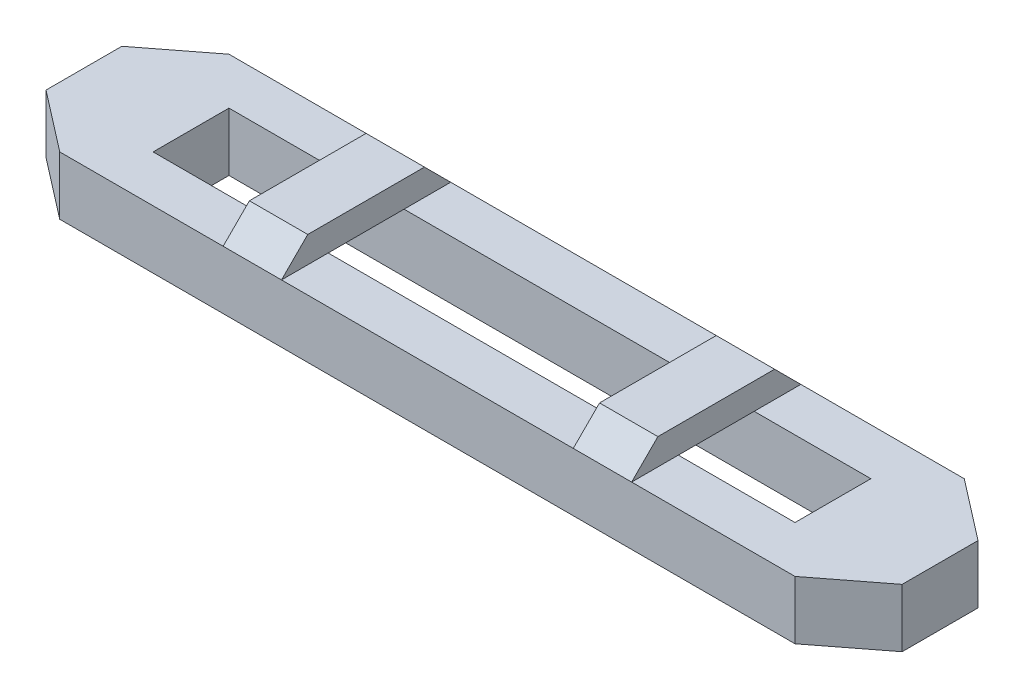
ISO-10303-21;
HEADER;
FILE_DESCRIPTION(('STEP AP214'),'2;1');
FILE_NAME('part.step','',(''),(''),'','','');
FILE_SCHEMA(('AUTOMOTIVE_DESIGN { 1 0 10303 214 1 1 1 1 }'));
ENDSEC;
DATA;
#1=APPLICATION_CONTEXT('core data for automotive mechanical design processes');
#2=APPLICATION_PROTOCOL_DEFINITION('international standard','automotive_design',2000,#1);
#3=PRODUCT_CONTEXT('',#1,'mechanical');
#4=PRODUCT('Part','Part','',(#3));
#5=PRODUCT_RELATED_PRODUCT_CATEGORY('part','',(#4));
#6=PRODUCT_DEFINITION_FORMATION('','',#4);
#7=PRODUCT_DEFINITION_CONTEXT('part definition',#1,'design');
#8=PRODUCT_DEFINITION('design','',#6,#7);
#9=PRODUCT_DEFINITION_SHAPE('','',#8);
#10=(LENGTH_UNIT() NAMED_UNIT(*) SI_UNIT(.MILLI.,.METRE.));
#11=(NAMED_UNIT(*) PLANE_ANGLE_UNIT() SI_UNIT($,.RADIAN.));
#12=(NAMED_UNIT(*) SI_UNIT($,.STERADIAN.) SOLID_ANGLE_UNIT());
#13=UNCERTAINTY_MEASURE_WITH_UNIT(LENGTH_MEASURE(1.E-05),#10,'distance_accuracy_value','');
#14=(GEOMETRIC_REPRESENTATION_CONTEXT(3) GLOBAL_UNCERTAINTY_ASSIGNED_CONTEXT((#13)) GLOBAL_UNIT_ASSIGNED_CONTEXT((#10,
#11,#12)) REPRESENTATION_CONTEXT('',''));
#15=CARTESIAN_POINT('',(0.,0.,0.));
#16=DIRECTION('',(0.,0.,1.));
#17=DIRECTION('',(1.,0.,0.));
#18=AXIS2_PLACEMENT_3D('',#15,#16,#17);
#19=CARTESIAN_POINT('',(-81.7701905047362,10.,0.));
#20=DIRECTION('',(0.,-1.,0.));
#21=DIRECTION('',(0.,0.,-1.));
#22=AXIS2_PLACEMENT_3D('',#19,#20,#21);
#23=PLANE('',#22);
#24=DIRECTION('',(0.,0.,-1.));
#25=VECTOR('',#24,1.);
#26=CARTESIAN_POINT('',(-35.,10.,14.5));
#27=LINE('',#26,#25);
#28=CARTESIAN_POINT('',(-35.,10.,-6.5));
#29=VERTEX_POINT('',#28);
#30=CARTESIAN_POINT('',(-35.,10.,-14.5));
#31=VERTEX_POINT('',#30);
#32=EDGE_CURVE('E220',#29,#31,#27,.T.);
#33=ORIENTED_EDGE('',*,*,#32,.T.);
#34=DIRECTION('',(-1.,0.,0.));
#35=VECTOR('',#34,1.);
#36=CARTESIAN_POINT('',(-63.,10.,-14.5));
#37=LINE('',#36,#35);
#38=CARTESIAN_POINT('',(-63.,10.,-14.5));
#39=VERTEX_POINT('',#38);
#40=EDGE_CURVE('E440',#31,#39,#37,.T.);
#41=ORIENTED_EDGE('',*,*,#40,.T.);
#42=DIRECTION('',(-0.79137144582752,0.,0.611335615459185));
#43=VECTOR('',#42,1.);
#44=CARTESIAN_POINT('',(-63.,10.,-14.5));
#45=LINE('',#44,#43);
#46=CARTESIAN_POINT('',(-73.3559671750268,10.,-6.5));
#47=VERTEX_POINT('',#46);
#48=EDGE_CURVE('E370',#39,#47,#45,.T.);
#49=ORIENTED_EDGE('',*,*,#48,.T.);
#50=DIRECTION('',(0.,0.,1.));
#51=VECTOR('',#50,1.);
#52=CARTESIAN_POINT('',(-73.3559671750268,10.,-6.5));
#53=LINE('',#52,#51);
#54=CARTESIAN_POINT('',(-73.3559671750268,10.,6.5));
#55=VERTEX_POINT('',#54);
#56=EDGE_CURVE('E373',#47,#55,#53,.T.);
#57=ORIENTED_EDGE('',*,*,#56,.T.);
#58=DIRECTION('',(0.79137144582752,0.,0.611335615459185));
#59=VECTOR('',#58,1.);
#60=CARTESIAN_POINT('',(-63.,10.,14.5));
#61=LINE('',#60,#59);
#62=CARTESIAN_POINT('',(-63.,10.,14.5));
#63=VERTEX_POINT('',#62);
#64=EDGE_CURVE('E376',#55,#63,#61,.T.);
#65=ORIENTED_EDGE('',*,*,#64,.T.);
#66=DIRECTION('',(1.,0.,0.));
#67=VECTOR('',#66,1.);
#68=CARTESIAN_POINT('',(-63.,10.,14.5));
#69=LINE('',#68,#67);
#70=CARTESIAN_POINT('',(-35.,10.,14.5));
#71=VERTEX_POINT('',#70);
#72=EDGE_CURVE('E387',#63,#71,#69,.T.);
#73=ORIENTED_EDGE('',*,*,#72,.T.);
#74=CARTESIAN_POINT('',(-35.,10.,6.5));
#75=VERTEX_POINT('',#74);
#76=EDGE_CURVE('E214',#71,#75,#27,.T.);
#77=ORIENTED_EDGE('',*,*,#76,.T.);
#78=DIRECTION('',(1.,0.,0.));
#79=VECTOR('',#78,1.);
#80=CARTESIAN_POINT('',(-55.,10.,6.5));
#81=LINE('',#80,#79);
#82=CARTESIAN_POINT('',(-55.,10.,6.5));
#83=VERTEX_POINT('',#82);
#84=EDGE_CURVE('E328',#83,#75,#81,.T.);
#85=ORIENTED_EDGE('',*,*,#84,.F.);
#86=DIRECTION('',(0.,0.,1.));
#87=VECTOR('',#86,1.);
#88=CARTESIAN_POINT('',(-55.,10.,-6.5));
#89=LINE('',#88,#87);
#90=CARTESIAN_POINT('',(-55.,10.,-6.5));
#91=VERTEX_POINT('',#90);
#92=EDGE_CURVE('E329',#91,#83,#89,.T.);
#93=ORIENTED_EDGE('',*,*,#92,.F.);
#94=DIRECTION('',(-1.,0.,0.));
#95=VECTOR('',#94,1.);
#96=CARTESIAN_POINT('',(-55.,10.,-6.5));
#97=LINE('',#96,#95);
#98=EDGE_CURVE('E337',#29,#91,#97,.T.);
#99=ORIENTED_EDGE('',*,*,#98,.F.);
#100=EDGE_LOOP('',(#33,#41,#49,#57,#65,#73,#77,#85,#93,#99));
#101=FACE_BOUND('',#100,.T.);
#102=ADVANCED_FACE('F30',(#101),#23,.F.);
#103=CARTESIAN_POINT('',(25.,10.,-14.5));
#104=VERTEX_POINT('',#103);
#105=CARTESIAN_POINT('',(-25.,10.,-14.5));
#106=VERTEX_POINT('',#105);
#107=EDGE_CURVE('E435',#104,#106,#37,.T.);
#108=ORIENTED_EDGE('',*,*,#107,.T.);
#109=DIRECTION('',(0.,0.,-1.));
#110=VECTOR('',#109,1.);
#111=CARTESIAN_POINT('',(-25.,10.,14.5));
#112=LINE('',#111,#110);
#113=CARTESIAN_POINT('',(-25.,10.,-6.5));
#114=VERTEX_POINT('',#113);
#115=EDGE_CURVE('E231',#114,#106,#112,.T.);
#116=ORIENTED_EDGE('',*,*,#115,.F.);
#117=CARTESIAN_POINT('',(25.,10.,-6.5));
#118=VERTEX_POINT('',#117);
#119=EDGE_CURVE('E509',#118,#114,#97,.T.);
#120=ORIENTED_EDGE('',*,*,#119,.F.);
#121=DIRECTION('',(0.,0.,-1.));
#122=VECTOR('',#121,1.);
#123=CARTESIAN_POINT('',(25.,10.,14.5));
#124=LINE('',#123,#122);
#125=EDGE_CURVE('E11',#118,#104,#124,.T.);
#126=ORIENTED_EDGE('',*,*,#125,.T.);
#127=EDGE_LOOP('',(#108,#116,#120,#126));
#128=FACE_BOUND('',#127,.T.);
#129=ADVANCED_FACE('F510',(#128),#23,.F.);
#130=DIRECTION('',(0.,0.,-1.));
#131=VECTOR('',#130,1.);
#132=CARTESIAN_POINT('',(35.,10.,14.5));
#133=LINE('',#132,#131);
#134=CARTESIAN_POINT('',(35.,10.,14.5));
#135=VERTEX_POINT('',#134);
#136=CARTESIAN_POINT('',(35.,10.,6.5));
#137=VERTEX_POINT('',#136);
#138=EDGE_CURVE('E245',#135,#137,#133,.T.);
#139=ORIENTED_EDGE('',*,*,#138,.F.);
#140=CARTESIAN_POINT('',(63.,10.,14.5));
#141=VERTEX_POINT('',#140);
#142=EDGE_CURVE('E377',#135,#141,#69,.T.);
#143=ORIENTED_EDGE('',*,*,#142,.T.);
#144=DIRECTION('',(0.79137144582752,0.,-0.611335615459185));
#145=VECTOR('',#144,1.);
#146=CARTESIAN_POINT('',(63.,10.,14.5));
#147=LINE('',#146,#145);
#148=CARTESIAN_POINT('',(73.3559671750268,10.,6.5));
#149=VERTEX_POINT('',#148);
#150=EDGE_CURVE('E380',#141,#149,#147,.T.);
#151=ORIENTED_EDGE('',*,*,#150,.T.);
#152=DIRECTION('',(0.,0.,-1.));
#153=VECTOR('',#152,1.);
#154=CARTESIAN_POINT('',(73.3559671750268,10.,-6.5));
#155=LINE('',#154,#153);
#156=CARTESIAN_POINT('',(73.3559671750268,10.,-6.5));
#157=VERTEX_POINT('',#156);
#158=EDGE_CURVE('E448',#149,#157,#155,.T.);
#159=ORIENTED_EDGE('',*,*,#158,.T.);
#160=DIRECTION('',(-0.79137144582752,0.,-0.611335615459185));
#161=VECTOR('',#160,1.);
#162=CARTESIAN_POINT('',(63.,10.,-14.5));
#163=LINE('',#162,#161);
#164=CARTESIAN_POINT('',(63.,10.,-14.5));
#165=VERTEX_POINT('',#164);
#166=EDGE_CURVE('E432',#157,#165,#163,.T.);
#167=ORIENTED_EDGE('',*,*,#166,.T.);
#168=CARTESIAN_POINT('',(35.,10.,-14.5));
#169=VERTEX_POINT('',#168);
#170=EDGE_CURVE('E414',#165,#169,#37,.T.);
#171=ORIENTED_EDGE('',*,*,#170,.T.);
#172=CARTESIAN_POINT('',(35.,10.,-6.5));
#173=VERTEX_POINT('',#172);
#174=EDGE_CURVE('E40',#173,#169,#133,.T.);
#175=ORIENTED_EDGE('',*,*,#174,.F.);
#176=CARTESIAN_POINT('',(55.,10.,-6.5));
#177=VERTEX_POINT('',#176);
#178=EDGE_CURVE('E344',#177,#173,#97,.T.);
#179=ORIENTED_EDGE('',*,*,#178,.F.);
#180=DIRECTION('',(0.,0.,-1.));
#181=VECTOR('',#180,1.);
#182=CARTESIAN_POINT('',(55.,10.,-6.5));
#183=LINE('',#182,#181);
#184=CARTESIAN_POINT('',(55.,10.,6.5));
#185=VERTEX_POINT('',#184);
#186=EDGE_CURVE('E333',#185,#177,#183,.T.);
#187=ORIENTED_EDGE('',*,*,#186,.F.);
#188=EDGE_CURVE('E326',#137,#185,#81,.T.);
#189=ORIENTED_EDGE('',*,*,#188,.F.);
#190=EDGE_LOOP('',(#139,#143,#151,#159,#167,#171,#175,#179,#187,#189));
#191=FACE_BOUND('',#190,.T.);
#192=ADVANCED_FACE('F456',(#191),#23,.F.);
#193=CARTESIAN_POINT('',(-25.,10.,6.5));
#194=VERTEX_POINT('',#193);
#195=CARTESIAN_POINT('',(25.,10.,6.5));
#196=VERTEX_POINT('',#195);
#197=EDGE_CURVE('E316',#194,#196,#81,.T.);
#198=ORIENTED_EDGE('',*,*,#197,.F.);
#199=CARTESIAN_POINT('',(-25.,10.,14.5));
#200=VERTEX_POINT('',#199);
#201=EDGE_CURVE('E48',#200,#194,#112,.T.);
#202=ORIENTED_EDGE('',*,*,#201,.F.);
#203=CARTESIAN_POINT('',(25.,10.,14.5));
#204=VERTEX_POINT('',#203);
#205=EDGE_CURVE('E34',#200,#204,#69,.T.);
#206=ORIENTED_EDGE('',*,*,#205,.T.);
#207=EDGE_CURVE('E271',#204,#196,#124,.T.);
#208=ORIENTED_EDGE('',*,*,#207,.T.);
#209=EDGE_LOOP('',(#198,#202,#206,#208));
#210=FACE_BOUND('',#209,.T.);
#211=ADVANCED_FACE('F315',(#210),#23,.F.);
#212=CARTESIAN_POINT('',(-81.7701905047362,0.,0.));
#213=DIRECTION('',(0.,-1.,0.));
#214=DIRECTION('',(0.,0.,-1.));
#215=AXIS2_PLACEMENT_3D('',#212,#213,#214);
#216=PLANE('',#215);
#217=DIRECTION('',(-0.79137144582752,0.,0.611335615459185));
#218=VECTOR('',#217,1.);
#219=CARTESIAN_POINT('',(-63.,0.,-14.5));
#220=LINE('',#219,#218);
#221=CARTESIAN_POINT('',(-63.,0.,-14.5));
#222=VERTEX_POINT('',#221);
#223=CARTESIAN_POINT('',(-73.3559671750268,0.,-6.5));
#224=VERTEX_POINT('',#223);
#225=EDGE_CURVE('E369',#222,#224,#220,.T.);
#226=ORIENTED_EDGE('',*,*,#225,.F.);
#227=DIRECTION('',(-1.,0.,0.));
#228=VECTOR('',#227,1.);
#229=CARTESIAN_POINT('',(-63.,0.,-14.5));
#230=LINE('',#229,#228);
#231=CARTESIAN_POINT('',(63.,0.,-14.5));
#232=VERTEX_POINT('',#231);
#233=EDGE_CURVE('E374',#232,#222,#230,.T.);
#234=ORIENTED_EDGE('',*,*,#233,.F.);
#235=DIRECTION('',(-0.79137144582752,0.,-0.611335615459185));
#236=VECTOR('',#235,1.);
#237=CARTESIAN_POINT('',(63.,0.,-14.5));
#238=LINE('',#237,#236);
#239=CARTESIAN_POINT('',(73.3559671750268,0.,-6.5));
#240=VERTEX_POINT('',#239);
#241=EDGE_CURVE('E416',#240,#232,#238,.T.);
#242=ORIENTED_EDGE('',*,*,#241,.F.);
#243=DIRECTION('',(0.,0.,-1.));
#244=VECTOR('',#243,1.);
#245=CARTESIAN_POINT('',(73.3559671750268,0.,-6.5));
#246=LINE('',#245,#244);
#247=CARTESIAN_POINT('',(73.3559671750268,0.,6.5));
#248=VERTEX_POINT('',#247);
#249=EDGE_CURVE('E418',#248,#240,#246,.T.);
#250=ORIENTED_EDGE('',*,*,#249,.F.);
#251=DIRECTION('',(0.79137144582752,0.,-0.611335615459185));
#252=VECTOR('',#251,1.);
#253=CARTESIAN_POINT('',(63.,0.,14.5));
#254=LINE('',#253,#252);
#255=CARTESIAN_POINT('',(63.,0.,14.5));
#256=VERTEX_POINT('',#255);
#257=EDGE_CURVE('E420',#256,#248,#254,.T.);
#258=ORIENTED_EDGE('',*,*,#257,.F.);
#259=DIRECTION('',(1.,0.,0.));
#260=VECTOR('',#259,1.);
#261=CARTESIAN_POINT('',(-63.,0.,14.5));
#262=LINE('',#261,#260);
#263=CARTESIAN_POINT('',(-63.,0.,14.5));
#264=VERTEX_POINT('',#263);
#265=EDGE_CURVE('E422',#264,#256,#262,.T.);
#266=ORIENTED_EDGE('',*,*,#265,.F.);
#267=DIRECTION('',(0.79137144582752,0.,0.611335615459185));
#268=VECTOR('',#267,1.);
#269=CARTESIAN_POINT('',(-63.,0.,14.5));
#270=LINE('',#269,#268);
#271=CARTESIAN_POINT('',(-73.3559671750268,0.,6.5));
#272=VERTEX_POINT('',#271);
#273=EDGE_CURVE('E424',#272,#264,#270,.T.);
#274=ORIENTED_EDGE('',*,*,#273,.F.);
#275=DIRECTION('',(0.,0.,1.));
#276=VECTOR('',#275,1.);
#277=CARTESIAN_POINT('',(-73.3559671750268,0.,-6.5));
#278=LINE('',#277,#276);
#279=EDGE_CURVE('E426',#224,#272,#278,.T.);
#280=ORIENTED_EDGE('',*,*,#279,.F.);
#281=EDGE_LOOP('',(#226,#234,#242,#250,#258,#266,#274,#280));
#282=FACE_BOUND('',#281,.T.);
#283=DIRECTION('',(-1.,0.,0.));
#284=VECTOR('',#283,1.);
#285=CARTESIAN_POINT('',(-55.,0.,-6.5));
#286=LINE('',#285,#284);
#287=CARTESIAN_POINT('',(55.,0.,-6.5));
#288=VERTEX_POINT('',#287);
#289=CARTESIAN_POINT('',(-55.,0.,-6.5));
#290=VERTEX_POINT('',#289);
#291=EDGE_CURVE('E357',#288,#290,#286,.T.);
#292=ORIENTED_EDGE('',*,*,#291,.T.);
#293=DIRECTION('',(0.,0.,1.));
#294=VECTOR('',#293,1.);
#295=CARTESIAN_POINT('',(-55.,0.,-6.5));
#296=LINE('',#295,#294);
#297=CARTESIAN_POINT('',(-55.,0.,6.5));
#298=VERTEX_POINT('',#297);
#299=EDGE_CURVE('E267',#290,#298,#296,.T.);
#300=ORIENTED_EDGE('',*,*,#299,.T.);
#301=DIRECTION('',(1.,0.,0.));
#302=VECTOR('',#301,1.);
#303=CARTESIAN_POINT('',(-55.,0.,6.5));
#304=LINE('',#303,#302);
#305=CARTESIAN_POINT('',(55.,0.,6.5));
#306=VERTEX_POINT('',#305);
#307=EDGE_CURVE('E351',#298,#306,#304,.T.);
#308=ORIENTED_EDGE('',*,*,#307,.T.);
#309=DIRECTION('',(0.,0.,-1.));
#310=VECTOR('',#309,1.);
#311=CARTESIAN_POINT('',(55.,0.,-6.5));
#312=LINE('',#311,#310);
#313=EDGE_CURVE('E354',#306,#288,#312,.T.);
#314=ORIENTED_EDGE('',*,*,#313,.T.);
#315=EDGE_LOOP('',(#292,#300,#308,#314));
#316=FACE_BOUND('',#315,.T.);
#317=ADVANCED_FACE('F482',(#282,#316),#216,.T.);
#318=CARTESIAN_POINT('',(-63.,10.,-14.5));
#319=DIRECTION('',(0.611335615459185,0.,0.79137144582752));
#320=DIRECTION('',(0.79137144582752,0.,-0.611335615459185));
#321=AXIS2_PLACEMENT_3D('',#318,#319,#320);
#322=PLANE('',#321);
#323=ORIENTED_EDGE('',*,*,#225,.T.);
#324=DIRECTION('',(0.,-1.,0.));
#325=VECTOR('',#324,1.);
#326=CARTESIAN_POINT('',(-73.3559671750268,10.,-6.5));
#327=LINE('',#326,#325);
#328=EDGE_CURVE('E390',#47,#224,#327,.T.);
#329=ORIENTED_EDGE('',*,*,#328,.F.);
#330=ORIENTED_EDGE('',*,*,#48,.F.);
#331=DIRECTION('',(0.,-1.,0.));
#332=VECTOR('',#331,1.);
#333=CARTESIAN_POINT('',(-63.,10.,-14.5));
#334=LINE('',#333,#332);
#335=EDGE_CURVE('E411',#39,#222,#334,.T.);
#336=ORIENTED_EDGE('',*,*,#335,.T.);
#337=EDGE_LOOP('',(#323,#329,#330,#336));
#338=FACE_BOUND('',#337,.T.);
#339=ADVANCED_FACE('F32',(#338),#322,.F.);
#340=CARTESIAN_POINT('',(-73.3559671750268,10.,-6.5));
#341=DIRECTION('',(1.,0.,0.));
#342=DIRECTION('',(0.,0.,-1.));
#343=AXIS2_PLACEMENT_3D('',#340,#341,#342);
#344=PLANE('',#343);
#345=ORIENTED_EDGE('',*,*,#279,.T.);
#346=DIRECTION('',(0.,-1.,0.));
#347=VECTOR('',#346,1.);
#348=CARTESIAN_POINT('',(-73.3559671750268,10.,6.5));
#349=LINE('',#348,#347);
#350=EDGE_CURVE('E393',#55,#272,#349,.T.);
#351=ORIENTED_EDGE('',*,*,#350,.F.);
#352=ORIENTED_EDGE('',*,*,#56,.F.);
#353=ORIENTED_EDGE('',*,*,#328,.T.);
#354=EDGE_LOOP('',(#345,#351,#352,#353));
#355=FACE_BOUND('',#354,.T.);
#356=ADVANCED_FACE('F492',(#355),#344,.F.);
#357=CARTESIAN_POINT('',(-63.,10.,14.5));
#358=DIRECTION('',(0.611335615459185,0.,-0.79137144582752));
#359=DIRECTION('',(-0.79137144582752,0.,-0.611335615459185));
#360=AXIS2_PLACEMENT_3D('',#357,#358,#359);
#361=PLANE('',#360);
#362=ORIENTED_EDGE('',*,*,#273,.T.);
#363=DIRECTION('',(0.,-1.,0.));
#364=VECTOR('',#363,1.);
#365=CARTESIAN_POINT('',(-63.,10.,14.5));
#366=LINE('',#365,#364);
#367=EDGE_CURVE('E396',#63,#264,#366,.T.);
#368=ORIENTED_EDGE('',*,*,#367,.F.);
#369=ORIENTED_EDGE('',*,*,#64,.F.);
#370=ORIENTED_EDGE('',*,*,#350,.T.);
#371=EDGE_LOOP('',(#362,#368,#369,#370));
#372=FACE_BOUND('',#371,.T.);
#373=ADVANCED_FACE('F494',(#372),#361,.F.);
#374=CARTESIAN_POINT('',(-63.,10.,14.5));
#375=DIRECTION('',(0.,0.,-1.));
#376=DIRECTION('',(-1.,0.,0.));
#377=AXIS2_PLACEMENT_3D('',#374,#375,#376);
#378=PLANE('',#377);
#379=ORIENTED_EDGE('',*,*,#265,.T.);
#380=DIRECTION('',(0.,-1.,0.));
#381=VECTOR('',#380,1.);
#382=CARTESIAN_POINT('',(63.,10.,14.5));
#383=LINE('',#382,#381);
#384=EDGE_CURVE('E399',#141,#256,#383,.T.);
#385=ORIENTED_EDGE('',*,*,#384,.F.);
#386=ORIENTED_EDGE('',*,*,#142,.F.);
#387=DIRECTION('',(-1.,0.,0.));
#388=VECTOR('',#387,1.);
#389=CARTESIAN_POINT('',(35.,10.,14.5));
#390=LINE('',#389,#388);
#391=EDGE_CURVE('E264',#135,#204,#390,.T.);
#392=ORIENTED_EDGE('',*,*,#391,.T.);
#393=ORIENTED_EDGE('',*,*,#205,.F.);
#394=DIRECTION('',(1.,0.,0.));
#395=VECTOR('',#394,1.);
#396=CARTESIAN_POINT('',(-35.,10.,14.5));
#397=LINE('',#396,#395);
#398=EDGE_CURVE('E224',#71,#200,#397,.T.);
#399=ORIENTED_EDGE('',*,*,#398,.F.);
#400=ORIENTED_EDGE('',*,*,#72,.F.);
#401=ORIENTED_EDGE('',*,*,#367,.T.);
#402=EDGE_LOOP('',(#379,#385,#386,#392,#393,#399,#400,#401));
#403=FACE_BOUND('',#402,.T.);
#404=ADVANCED_FACE('F478',(#403),#378,.F.);
#405=CARTESIAN_POINT('',(63.,10.,14.5));
#406=DIRECTION('',(-0.611335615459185,0.,-0.79137144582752));
#407=DIRECTION('',(-0.79137144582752,0.,0.611335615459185));
#408=AXIS2_PLACEMENT_3D('',#405,#406,#407);
#409=PLANE('',#408);
#410=ORIENTED_EDGE('',*,*,#257,.T.);
#411=DIRECTION('',(0.,-1.,0.));
#412=VECTOR('',#411,1.);
#413=CARTESIAN_POINT('',(73.3559671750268,10.,6.5));
#414=LINE('',#413,#412);
#415=EDGE_CURVE('E402',#149,#248,#414,.T.);
#416=ORIENTED_EDGE('',*,*,#415,.F.);
#417=ORIENTED_EDGE('',*,*,#150,.F.);
#418=ORIENTED_EDGE('',*,*,#384,.T.);
#419=EDGE_LOOP('',(#410,#416,#417,#418));
#420=FACE_BOUND('',#419,.T.);
#421=ADVANCED_FACE('F460',(#420),#409,.F.);
#422=CARTESIAN_POINT('',(73.3559671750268,10.,-6.5));
#423=DIRECTION('',(-1.,0.,0.));
#424=DIRECTION('',(0.,0.,1.));
#425=AXIS2_PLACEMENT_3D('',#422,#423,#424);
#426=PLANE('',#425);
#427=ORIENTED_EDGE('',*,*,#249,.T.);
#428=DIRECTION('',(0.,-1.,0.));
#429=VECTOR('',#428,1.);
#430=CARTESIAN_POINT('',(73.3559671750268,10.,-6.5));
#431=LINE('',#430,#429);
#432=EDGE_CURVE('E405',#157,#240,#431,.T.);
#433=ORIENTED_EDGE('',*,*,#432,.F.);
#434=ORIENTED_EDGE('',*,*,#158,.F.);
#435=ORIENTED_EDGE('',*,*,#415,.T.);
#436=EDGE_LOOP('',(#427,#433,#434,#435));
#437=FACE_BOUND('',#436,.T.);
#438=ADVANCED_FACE('F464',(#437),#426,.F.);
#439=CARTESIAN_POINT('',(63.,10.,-14.5));
#440=DIRECTION('',(-0.611335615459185,0.,0.79137144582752));
#441=DIRECTION('',(0.79137144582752,0.,0.611335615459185));
#442=AXIS2_PLACEMENT_3D('',#439,#440,#441);
#443=PLANE('',#442);
#444=ORIENTED_EDGE('',*,*,#241,.T.);
#445=DIRECTION('',(0.,-1.,0.));
#446=VECTOR('',#445,1.);
#447=CARTESIAN_POINT('',(63.,10.,-14.5));
#448=LINE('',#447,#446);
#449=EDGE_CURVE('E408',#165,#232,#448,.T.);
#450=ORIENTED_EDGE('',*,*,#449,.F.);
#451=ORIENTED_EDGE('',*,*,#166,.F.);
#452=ORIENTED_EDGE('',*,*,#432,.T.);
#453=EDGE_LOOP('',(#444,#450,#451,#452));
#454=FACE_BOUND('',#453,.T.);
#455=ADVANCED_FACE('F467',(#454),#443,.F.);
#456=CARTESIAN_POINT('',(-63.,10.,-14.5));
#457=DIRECTION('',(0.,0.,1.));
#458=DIRECTION('',(1.,0.,0.));
#459=AXIS2_PLACEMENT_3D('',#456,#457,#458);
#460=PLANE('',#459);
#461=ORIENTED_EDGE('',*,*,#233,.T.);
#462=ORIENTED_EDGE('',*,*,#335,.F.);
#463=ORIENTED_EDGE('',*,*,#40,.F.);
#464=DIRECTION('',(1.,0.,0.));
#465=VECTOR('',#464,1.);
#466=CARTESIAN_POINT('',(-35.,10.,-14.5));
#467=LINE('',#466,#465);
#468=EDGE_CURVE('E235',#31,#106,#467,.T.);
#469=ORIENTED_EDGE('',*,*,#468,.T.);
#470=ORIENTED_EDGE('',*,*,#107,.F.);
#471=DIRECTION('',(-1.,0.,0.));
#472=VECTOR('',#471,1.);
#473=CARTESIAN_POINT('',(35.,10.,-14.5));
#474=LINE('',#473,#472);
#475=EDGE_CURVE('E268',#169,#104,#474,.T.);
#476=ORIENTED_EDGE('',*,*,#475,.F.);
#477=ORIENTED_EDGE('',*,*,#170,.F.);
#478=ORIENTED_EDGE('',*,*,#449,.T.);
#479=EDGE_LOOP('',(#461,#462,#463,#469,#470,#476,#477,#478));
#480=FACE_BOUND('',#479,.T.);
#481=ADVANCED_FACE('F470',(#480),#460,.F.);
#482=CARTESIAN_POINT('',(-55.,10.,-6.5));
#483=DIRECTION('',(1.,0.,0.));
#484=DIRECTION('',(0.,0.,-1.));
#485=AXIS2_PLACEMENT_3D('',#482,#483,#484);
#486=PLANE('',#485);
#487=ORIENTED_EDGE('',*,*,#299,.F.);
#488=DIRECTION('',(0.,-1.,0.));
#489=VECTOR('',#488,1.);
#490=CARTESIAN_POINT('',(-55.,10.,-6.5));
#491=LINE('',#490,#489);
#492=EDGE_CURVE('E347',#91,#290,#491,.T.);
#493=ORIENTED_EDGE('',*,*,#492,.F.);
#494=ORIENTED_EDGE('',*,*,#92,.T.);
#495=DIRECTION('',(0.,-1.,0.));
#496=VECTOR('',#495,1.);
#497=CARTESIAN_POINT('',(-55.,10.,6.5));
#498=LINE('',#497,#496);
#499=EDGE_CURVE('E366',#83,#298,#498,.T.);
#500=ORIENTED_EDGE('',*,*,#499,.T.);
#501=EDGE_LOOP('',(#487,#493,#494,#500));
#502=FACE_BOUND('',#501,.T.);
#503=ADVANCED_FACE('F501',(#502),#486,.T.);
#504=CARTESIAN_POINT('',(-55.,10.,6.5));
#505=DIRECTION('',(0.,0.,-1.));
#506=DIRECTION('',(-1.,0.,0.));
#507=AXIS2_PLACEMENT_3D('',#504,#505,#506);
#508=PLANE('',#507);
#509=ORIENTED_EDGE('',*,*,#307,.F.);
#510=ORIENTED_EDGE('',*,*,#499,.F.);
#511=ORIENTED_EDGE('',*,*,#84,.T.);
#512=DIRECTION('',(-1.,0.,0.));
#513=VECTOR('',#512,1.);
#514=CARTESIAN_POINT('',(-55.,10.,6.5));
#515=LINE('',#514,#513);
#516=EDGE_CURVE('E204',#194,#75,#515,.T.);
#517=ORIENTED_EDGE('',*,*,#516,.F.);
#518=ORIENTED_EDGE('',*,*,#197,.T.);
#519=EDGE_CURVE('E321',#196,#137,#81,.T.);
#520=ORIENTED_EDGE('',*,*,#519,.T.);
#521=ORIENTED_EDGE('',*,*,#188,.T.);
#522=DIRECTION('',(0.,-1.,0.));
#523=VECTOR('',#522,1.);
#524=CARTESIAN_POINT('',(55.,10.,6.5));
#525=LINE('',#524,#523);
#526=EDGE_CURVE('E364',#185,#306,#525,.T.);
#527=ORIENTED_EDGE('',*,*,#526,.T.);
#528=EDGE_LOOP('',(#509,#510,#511,#517,#518,#520,#521,#527));
#529=FACE_BOUND('',#528,.T.);
#530=ADVANCED_FACE('F502',(#529),#508,.T.);
#531=CARTESIAN_POINT('',(55.,10.,-6.5));
#532=DIRECTION('',(-1.,0.,0.));
#533=DIRECTION('',(0.,0.,1.));
#534=AXIS2_PLACEMENT_3D('',#531,#532,#533);
#535=PLANE('',#534);
#536=ORIENTED_EDGE('',*,*,#313,.F.);
#537=ORIENTED_EDGE('',*,*,#526,.F.);
#538=ORIENTED_EDGE('',*,*,#186,.T.);
#539=DIRECTION('',(0.,-1.,0.));
#540=VECTOR('',#539,1.);
#541=CARTESIAN_POINT('',(55.,10.,-6.5));
#542=LINE('',#541,#540);
#543=EDGE_CURVE('E362',#177,#288,#542,.T.);
#544=ORIENTED_EDGE('',*,*,#543,.T.);
#545=EDGE_LOOP('',(#536,#537,#538,#544));
#546=FACE_BOUND('',#545,.T.);
#547=ADVANCED_FACE('F586',(#546),#535,.T.);
#548=CARTESIAN_POINT('',(-55.,10.,-6.5));
#549=DIRECTION('',(0.,0.,1.));
#550=DIRECTION('',(1.,0.,0.));
#551=AXIS2_PLACEMENT_3D('',#548,#549,#550);
#552=PLANE('',#551);
#553=ORIENTED_EDGE('',*,*,#291,.F.);
#554=ORIENTED_EDGE('',*,*,#543,.F.);
#555=ORIENTED_EDGE('',*,*,#178,.T.);
#556=EDGE_CURVE('E348',#173,#118,#97,.T.);
#557=ORIENTED_EDGE('',*,*,#556,.T.);
#558=ORIENTED_EDGE('',*,*,#119,.T.);
#559=EDGE_CURVE('E342',#114,#29,#97,.T.);
#560=ORIENTED_EDGE('',*,*,#559,.T.);
#561=ORIENTED_EDGE('',*,*,#98,.T.);
#562=ORIENTED_EDGE('',*,*,#492,.T.);
#563=EDGE_LOOP('',(#553,#554,#555,#557,#558,#560,#561,#562));
#564=FACE_BOUND('',#563,.T.);
#565=ADVANCED_FACE('F506',(#564),#552,.T.);
#566=CARTESIAN_POINT('',(35.,14.5,10.));
#567=DIRECTION('',(0.,-0.707106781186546,-0.707106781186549));
#568=DIRECTION('',(0.,0.707106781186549,-0.707106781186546));
#569=AXIS2_PLACEMENT_3D('',#566,#567,#568);
#570=PLANE('',#569);
#571=DIRECTION('',(0.,-0.707106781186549,0.707106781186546));
#572=VECTOR('',#571,1.);
#573=CARTESIAN_POINT('',(25.,14.5,10.));
#574=LINE('',#573,#572);
#575=CARTESIAN_POINT('',(25.,14.5,10.));
#576=VERTEX_POINT('',#575);
#577=EDGE_CURVE('E240',#576,#204,#574,.T.);
#578=ORIENTED_EDGE('',*,*,#577,.T.);
#579=ORIENTED_EDGE('',*,*,#391,.F.);
#580=DIRECTION('',(0.,-0.707106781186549,0.707106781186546));
#581=VECTOR('',#580,1.);
#582=CARTESIAN_POINT('',(35.,14.5,10.));
#583=LINE('',#582,#581);
#584=CARTESIAN_POINT('',(35.,14.5,10.));
#585=VERTEX_POINT('',#584);
#586=EDGE_CURVE('E246',#585,#135,#583,.T.);
#587=ORIENTED_EDGE('',*,*,#586,.F.);
#588=DIRECTION('',(-1.,0.,0.));
#589=VECTOR('',#588,1.);
#590=CARTESIAN_POINT('',(35.,14.5,10.));
#591=LINE('',#590,#589);
#592=EDGE_CURVE('E300',#585,#576,#591,.T.);
#593=ORIENTED_EDGE('',*,*,#592,.T.);
#594=EDGE_LOOP('',(#578,#579,#587,#593));
#595=FACE_BOUND('',#594,.T.);
#596=ADVANCED_FACE('F306',(#595),#570,.F.);
#597=CARTESIAN_POINT('',(35.,10.,14.5));
#598=DIRECTION('',(0.,1.,0.));
#599=DIRECTION('',(0.,0.,1.));
#600=AXIS2_PLACEMENT_3D('',#597,#598,#599);
#601=PLANE('',#600);
#602=ORIENTED_EDGE('',*,*,#556,.F.);
#603=EDGE_CURVE('E241',#137,#173,#133,.T.);
#604=ORIENTED_EDGE('',*,*,#603,.F.);
#605=ORIENTED_EDGE('',*,*,#519,.F.);
#606=EDGE_CURVE('E275',#196,#118,#124,.T.);
#607=ORIENTED_EDGE('',*,*,#606,.T.);
#608=EDGE_LOOP('',(#602,#604,#605,#607));
#609=FACE_BOUND('',#608,.T.);
#610=ADVANCED_FACE('F323',(#609),#601,.F.);
#611=CARTESIAN_POINT('',(35.,10.,-14.5));
#612=DIRECTION('',(0.,-0.707106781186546,0.707106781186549));
#613=DIRECTION('',(0.,-0.707106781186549,-0.707106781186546));
#614=AXIS2_PLACEMENT_3D('',#611,#612,#613);
#615=PLANE('',#614);
#616=DIRECTION('',(0.,0.707106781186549,0.707106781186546));
#617=VECTOR('',#616,1.);
#618=CARTESIAN_POINT('',(25.,10.,-14.5));
#619=LINE('',#618,#617);
#620=CARTESIAN_POINT('',(25.,14.5,-10.));
#621=VERTEX_POINT('',#620);
#622=EDGE_CURVE('E274',#104,#621,#619,.T.);
#623=ORIENTED_EDGE('',*,*,#622,.T.);
#624=DIRECTION('',(-1.,0.,0.));
#625=VECTOR('',#624,1.);
#626=CARTESIAN_POINT('',(35.,14.5,-10.));
#627=LINE('',#626,#625);
#628=CARTESIAN_POINT('',(35.,14.5,-10.));
#629=VERTEX_POINT('',#628);
#630=EDGE_CURVE('E285',#629,#621,#627,.T.);
#631=ORIENTED_EDGE('',*,*,#630,.F.);
#632=DIRECTION('',(0.,0.707106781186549,0.707106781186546));
#633=VECTOR('',#632,1.);
#634=CARTESIAN_POINT('',(35.,10.,-14.5));
#635=LINE('',#634,#633);
#636=EDGE_CURVE('E256',#169,#629,#635,.T.);
#637=ORIENTED_EDGE('',*,*,#636,.F.);
#638=ORIENTED_EDGE('',*,*,#475,.T.);
#639=EDGE_LOOP('',(#623,#631,#637,#638));
#640=FACE_BOUND('',#639,.T.);
#641=ADVANCED_FACE('F475',(#640),#615,.F.);
#642=CARTESIAN_POINT('',(35.,14.5,-10.));
#643=DIRECTION('',(0.,-1.,0.));
#644=DIRECTION('',(0.,0.,-1.));
#645=AXIS2_PLACEMENT_3D('',#642,#643,#644);
#646=PLANE('',#645);
#647=DIRECTION('',(0.,0.,1.));
#648=VECTOR('',#647,1.);
#649=CARTESIAN_POINT('',(25.,14.5,-10.));
#650=LINE('',#649,#648);
#651=EDGE_CURVE('E261',#621,#576,#650,.T.);
#652=ORIENTED_EDGE('',*,*,#651,.T.);
#653=ORIENTED_EDGE('',*,*,#592,.F.);
#654=DIRECTION('',(0.,0.,1.));
#655=VECTOR('',#654,1.);
#656=CARTESIAN_POINT('',(35.,14.5,-10.));
#657=LINE('',#656,#655);
#658=EDGE_CURVE('E247',#629,#585,#657,.T.);
#659=ORIENTED_EDGE('',*,*,#658,.F.);
#660=ORIENTED_EDGE('',*,*,#630,.T.);
#661=EDGE_LOOP('',(#652,#653,#659,#660));
#662=FACE_BOUND('',#661,.T.);
#663=ADVANCED_FACE('F298',(#662),#646,.F.);
#664=CARTESIAN_POINT('',(35.,24.5000000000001,0.));
#665=DIRECTION('',(-1.,0.,0.));
#666=DIRECTION('',(0.,0.,1.));
#667=AXIS2_PLACEMENT_3D('',#664,#665,#666);
#668=PLANE('',#667);
#669=ORIENTED_EDGE('',*,*,#586,.T.);
#670=ORIENTED_EDGE('',*,*,#138,.T.);
#671=ORIENTED_EDGE('',*,*,#603,.T.);
#672=ORIENTED_EDGE('',*,*,#174,.T.);
#673=ORIENTED_EDGE('',*,*,#636,.T.);
#674=ORIENTED_EDGE('',*,*,#658,.T.);
#675=EDGE_LOOP('',(#669,#670,#671,#672,#673,#674));
#676=FACE_BOUND('',#675,.T.);
#677=ADVANCED_FACE('F474',(#676),#668,.F.);
#678=CARTESIAN_POINT('',(25.,24.5000000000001,0.));
#679=DIRECTION('',(-1.,0.,0.));
#680=DIRECTION('',(0.,0.,1.));
#681=AXIS2_PLACEMENT_3D('',#678,#679,#680);
#682=PLANE('',#681);
#683=ORIENTED_EDGE('',*,*,#577,.F.);
#684=ORIENTED_EDGE('',*,*,#651,.F.);
#685=ORIENTED_EDGE('',*,*,#622,.F.);
#686=ORIENTED_EDGE('',*,*,#125,.F.);
#687=ORIENTED_EDGE('',*,*,#606,.F.);
#688=ORIENTED_EDGE('',*,*,#207,.F.);
#689=EDGE_LOOP('',(#683,#684,#685,#686,#687,#688));
#690=FACE_BOUND('',#689,.T.);
#691=ADVANCED_FACE('F309',(#690),#682,.T.);
#692=CARTESIAN_POINT('',(-35.,14.5,10.));
#693=DIRECTION('',(0.,0.707106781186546,0.707106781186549));
#694=DIRECTION('',(0.,-0.707106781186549,0.707106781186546));
#695=AXIS2_PLACEMENT_3D('',#692,#693,#694);
#696=PLANE('',#695);
#697=DIRECTION('',(0.,-0.707106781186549,0.707106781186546));
#698=VECTOR('',#697,1.);
#699=CARTESIAN_POINT('',(-25.,14.5,10.));
#700=LINE('',#699,#698);
#701=CARTESIAN_POINT('',(-25.,14.5,10.));
#702=VERTEX_POINT('',#701);
#703=EDGE_CURVE('E199',#702,#200,#700,.T.);
#704=ORIENTED_EDGE('',*,*,#703,.F.);
#705=DIRECTION('',(1.,0.,0.));
#706=VECTOR('',#705,1.);
#707=CARTESIAN_POINT('',(-35.,14.5,10.));
#708=LINE('',#707,#706);
#709=CARTESIAN_POINT('',(-35.,14.5,10.));
#710=VERTEX_POINT('',#709);
#711=EDGE_CURVE('E194',#710,#702,#708,.T.);
#712=ORIENTED_EDGE('',*,*,#711,.F.);
#713=DIRECTION('',(0.,-0.707106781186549,0.707106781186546));
#714=VECTOR('',#713,1.);
#715=CARTESIAN_POINT('',(-35.,14.5,10.));
#716=LINE('',#715,#714);
#717=EDGE_CURVE('E197',#710,#71,#716,.T.);
#718=ORIENTED_EDGE('',*,*,#717,.T.);
#719=ORIENTED_EDGE('',*,*,#398,.T.);
#720=EDGE_LOOP('',(#704,#712,#718,#719));
#721=FACE_BOUND('',#720,.T.);
#722=ADVANCED_FACE('F196',(#721),#696,.T.);
#723=CARTESIAN_POINT('',(-35.,14.5,-10.));
#724=DIRECTION('',(0.,1.,0.));
#725=DIRECTION('',(0.,0.,1.));
#726=AXIS2_PLACEMENT_3D('',#723,#724,#725);
#727=PLANE('',#726);
#728=DIRECTION('',(0.,0.,1.));
#729=VECTOR('',#728,1.);
#730=CARTESIAN_POINT('',(-25.,14.5,-10.));
#731=LINE('',#730,#729);
#732=CARTESIAN_POINT('',(-25.,14.5,-10.));
#733=VERTEX_POINT('',#732);
#734=EDGE_CURVE('E226',#733,#702,#731,.T.);
#735=ORIENTED_EDGE('',*,*,#734,.F.);
#736=DIRECTION('',(1.,0.,0.));
#737=VECTOR('',#736,1.);
#738=CARTESIAN_POINT('',(-35.,14.5,-10.));
#739=LINE('',#738,#737);
#740=CARTESIAN_POINT('',(-35.,14.5,-10.));
#741=VERTEX_POINT('',#740);
#742=EDGE_CURVE('E205',#741,#733,#739,.T.);
#743=ORIENTED_EDGE('',*,*,#742,.F.);
#744=DIRECTION('',(0.,0.,1.));
#745=VECTOR('',#744,1.);
#746=CARTESIAN_POINT('',(-35.,14.5,-10.));
#747=LINE('',#746,#745);
#748=EDGE_CURVE('E211',#741,#710,#747,.T.);
#749=ORIENTED_EDGE('',*,*,#748,.T.);
#750=ORIENTED_EDGE('',*,*,#711,.T.);
#751=EDGE_LOOP('',(#735,#743,#749,#750));
#752=FACE_BOUND('',#751,.T.);
#753=ADVANCED_FACE('F217',(#752),#727,.T.);
#754=CARTESIAN_POINT('',(-35.,10.,-14.5));
#755=DIRECTION('',(0.,0.707106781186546,-0.707106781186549));
#756=DIRECTION('',(0.,0.707106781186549,0.707106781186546));
#757=AXIS2_PLACEMENT_3D('',#754,#755,#756);
#758=PLANE('',#757);
#759=DIRECTION('',(0.,0.707106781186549,0.707106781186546));
#760=VECTOR('',#759,1.);
#761=CARTESIAN_POINT('',(-25.,10.,-14.5));
#762=LINE('',#761,#760);
#763=EDGE_CURVE('E228',#106,#733,#762,.T.);
#764=ORIENTED_EDGE('',*,*,#763,.F.);
#765=ORIENTED_EDGE('',*,*,#468,.F.);
#766=DIRECTION('',(0.,0.707106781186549,0.707106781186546));
#767=VECTOR('',#766,1.);
#768=CARTESIAN_POINT('',(-35.,10.,-14.5));
#769=LINE('',#768,#767);
#770=EDGE_CURVE('E218',#31,#741,#769,.T.);
#771=ORIENTED_EDGE('',*,*,#770,.T.);
#772=ORIENTED_EDGE('',*,*,#742,.T.);
#773=EDGE_LOOP('',(#764,#765,#771,#772));
#774=FACE_BOUND('',#773,.T.);
#775=ADVANCED_FACE('F515',(#774),#758,.T.);
#776=CARTESIAN_POINT('',(-35.,10.,14.5));
#777=DIRECTION('',(0.,-1.,0.));
#778=DIRECTION('',(0.,0.,-1.));
#779=AXIS2_PLACEMENT_3D('',#776,#777,#778);
#780=PLANE('',#779);
#781=EDGE_CURVE('E233',#194,#114,#112,.T.);
#782=ORIENTED_EDGE('',*,*,#781,.F.);
#783=ORIENTED_EDGE('',*,*,#516,.T.);
#784=EDGE_CURVE('E56',#75,#29,#27,.T.);
#785=ORIENTED_EDGE('',*,*,#784,.T.);
#786=ORIENTED_EDGE('',*,*,#559,.F.);
#787=EDGE_LOOP('',(#782,#783,#785,#786));
#788=FACE_BOUND('',#787,.T.);
#789=ADVANCED_FACE('F513',(#788),#780,.T.);
#790=CARTESIAN_POINT('',(-35.,24.5000000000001,0.));
#791=DIRECTION('',(1.,0.,0.));
#792=DIRECTION('',(0.,0.,1.));
#793=AXIS2_PLACEMENT_3D('',#790,#791,#792);
#794=PLANE('',#793);
#795=ORIENTED_EDGE('',*,*,#717,.F.);
#796=ORIENTED_EDGE('',*,*,#748,.F.);
#797=ORIENTED_EDGE('',*,*,#770,.F.);
#798=ORIENTED_EDGE('',*,*,#32,.F.);
#799=ORIENTED_EDGE('',*,*,#784,.F.);
#800=ORIENTED_EDGE('',*,*,#76,.F.);
#801=EDGE_LOOP('',(#795,#796,#797,#798,#799,#800));
#802=FACE_BOUND('',#801,.T.);
#803=ADVANCED_FACE('F209',(#802),#794,.F.);
#804=CARTESIAN_POINT('',(-25.,24.5000000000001,0.));
#805=DIRECTION('',(1.,0.,0.));
#806=DIRECTION('',(0.,0.,1.));
#807=AXIS2_PLACEMENT_3D('',#804,#805,#806);
#808=PLANE('',#807);
#809=ORIENTED_EDGE('',*,*,#703,.T.);
#810=ORIENTED_EDGE('',*,*,#201,.T.);
#811=ORIENTED_EDGE('',*,*,#781,.T.);
#812=ORIENTED_EDGE('',*,*,#115,.T.);
#813=ORIENTED_EDGE('',*,*,#763,.T.);
#814=ORIENTED_EDGE('',*,*,#734,.T.);
#815=EDGE_LOOP('',(#809,#810,#811,#812,#813,#814));
#816=FACE_BOUND('',#815,.T.);
#817=ADVANCED_FACE('F512',(#816),#808,.T.);
#818=CLOSED_SHELL('',(#102,#129,#192,#211,#317,#339,#356,#373,#404,#421,#438,#455,#481,#503,
#530,#547,#565,#596,#610,#641,#663,#677,#691,#722,#753,#775,#789,#803,#817));
#819=MANIFOLD_SOLID_BREP('B2',#818);
#820=ADVANCED_BREP_SHAPE_REPRESENTATION('',(#18,#819),#14);
#821=SHAPE_DEFINITION_REPRESENTATION(#9,#820);
ENDSEC;
END-ISO-10303-21;
